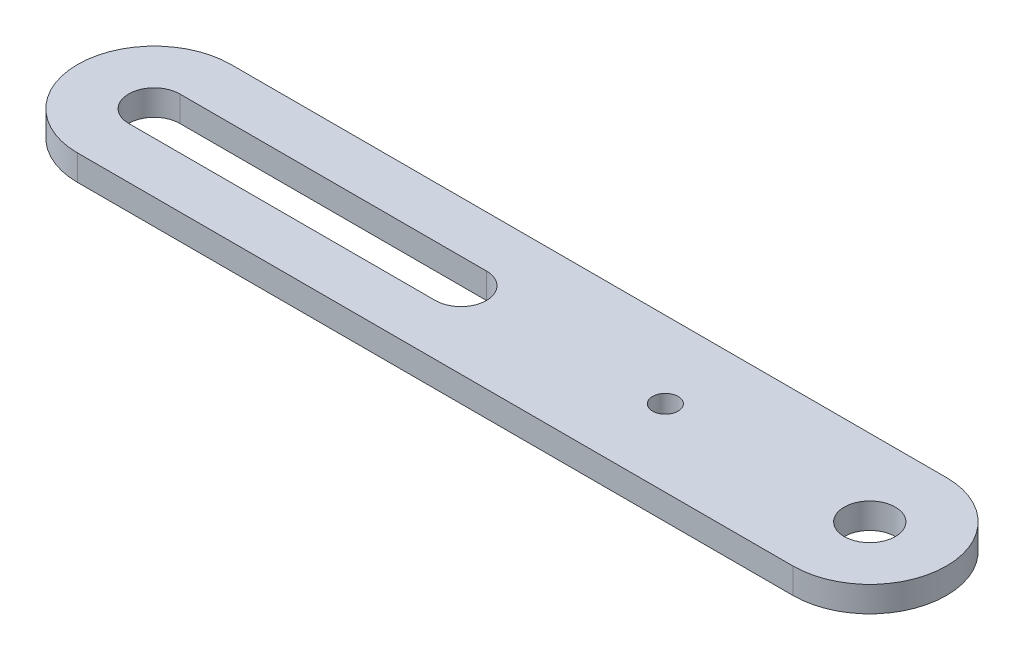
from build123d import *

# Parameters (mm, degrees)
BOSS_EXTRUDE1_DEPTH = 3.175
SKETCH2_R           = 6.35
SKETCH2_R_2         = 3.175
CUT_EXTRUDE1_DEPTH  = 110.801764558


with BuildPart() as part:
    # Sketch1 → Boss-Extrude1 (new, symmetric)
    with BuildSketch(Plane(origin=(0, 0, 0), x_dir=(1, 0, 0), z_dir=(0, 1, 0))):
        with BuildLine():
            Line((-88.9, -19.05), (88.9, -19.05))
            ThreePointArc((88.9, -19.05), (107.95, 0), (88.9, 19.05))
            Line((88.9, 19.05), (-88.9, 19.05))
            ThreePointArc((-88.9, 19.05), (-107.95, 0), (-88.9, -19.05))
        make_face()
    extrude(amount=BOSS_EXTRUDE1_DEPTH, both=True)

    # Sketch2 → Cut-Extrude1 (cut, through all)
    with BuildSketch(Plane(origin=(0, 3.175, 0), x_dir=(1, 0, 0), z_dir=(0, 1, 0))):
        with Locations(Location((88.9, 0, 0), (0, 0, 270))):
            Circle(SKETCH2_R)
        with Locations(Location((38.1, 0, 0), (0, 0, 270))):
            Circle(SKETCH2_R_2)
        with BuildLine():
            Line((-88.9, 6.35), (-12.7, 6.35))
            ThreePointArc((-12.7, 6.35), (-6.35, 0), (-12.7, -6.35))
            Line((-12.7, -6.35), (-88.9, -6.35))
            ThreePointArc((-88.9, -6.35), (-95.25, 0), (-88.9, 6.35))
        make_face()
    extrude(amount=-CUT_EXTRUDE1_DEPTH, mode=Mode.SUBTRACT)


solid = part.part
